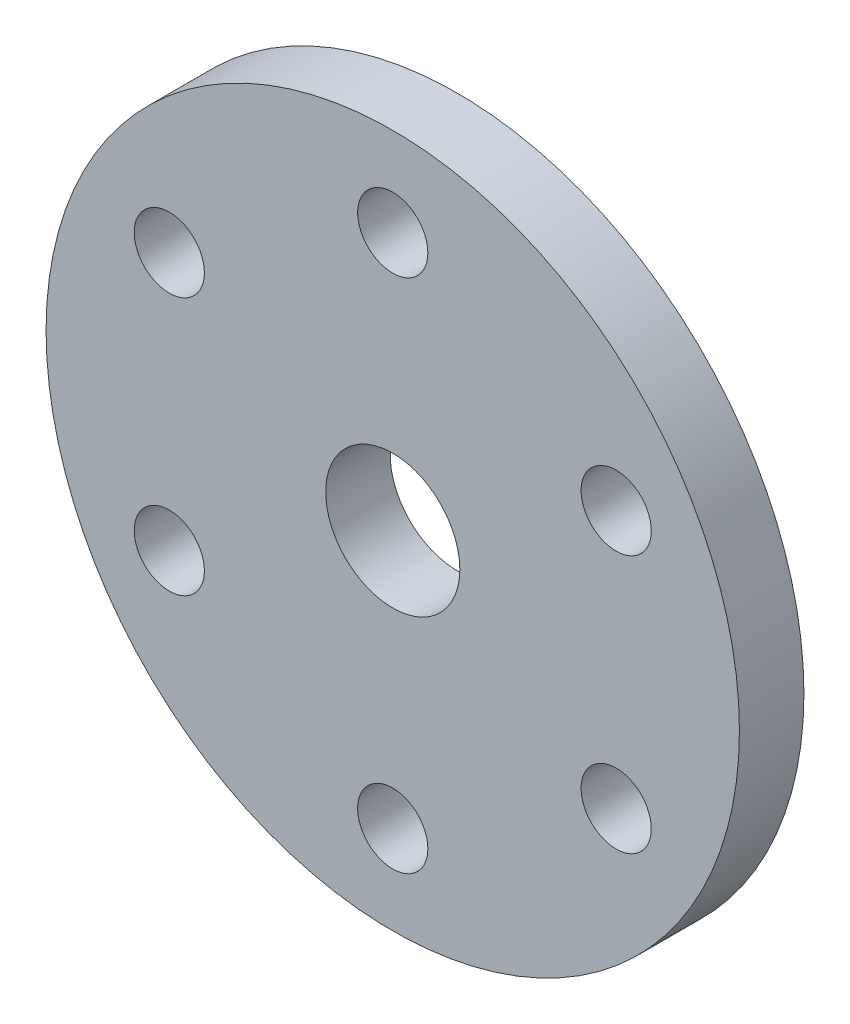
ISO-10303-21;
HEADER;
FILE_DESCRIPTION(('STEP AP214'),'2;1');
FILE_NAME('part.step','',(''),(''),'','','');
FILE_SCHEMA(('AUTOMOTIVE_DESIGN { 1 0 10303 214 1 1 1 1 }'));
ENDSEC;
DATA;
#1=APPLICATION_CONTEXT('core data for automotive mechanical design processes');
#2=APPLICATION_PROTOCOL_DEFINITION('international standard','automotive_design',2000,#1);
#3=PRODUCT_CONTEXT('',#1,'mechanical');
#4=PRODUCT('Part','Part','',(#3));
#5=PRODUCT_RELATED_PRODUCT_CATEGORY('part','',(#4));
#6=PRODUCT_DEFINITION_FORMATION('','',#4);
#7=PRODUCT_DEFINITION_CONTEXT('part definition',#1,'design');
#8=PRODUCT_DEFINITION('design','',#6,#7);
#9=PRODUCT_DEFINITION_SHAPE('','',#8);
#10=(LENGTH_UNIT() NAMED_UNIT(*) SI_UNIT(.MILLI.,.METRE.));
#11=(NAMED_UNIT(*) PLANE_ANGLE_UNIT() SI_UNIT($,.RADIAN.));
#12=(NAMED_UNIT(*) SI_UNIT($,.STERADIAN.) SOLID_ANGLE_UNIT());
#13=UNCERTAINTY_MEASURE_WITH_UNIT(LENGTH_MEASURE(1.E-05),#10,'distance_accuracy_value','');
#14=(GEOMETRIC_REPRESENTATION_CONTEXT(3) GLOBAL_UNCERTAINTY_ASSIGNED_CONTEXT((#13)) GLOBAL_UNIT_ASSIGNED_CONTEXT((#10,
#11,#12)) REPRESENTATION_CONTEXT('',''));
#15=CARTESIAN_POINT('',(0.,0.,0.));
#16=DIRECTION('',(0.,0.,1.));
#17=DIRECTION('',(1.,0.,0.));
#18=AXIS2_PLACEMENT_3D('',#15,#16,#17);
#19=CARTESIAN_POINT('',(0.,0.,3.175));
#20=DIRECTION('',(0.,0.,1.));
#21=DIRECTION('',(1.,0.,0.));
#22=AXIS2_PLACEMENT_3D('',#19,#20,#21);
#23=PLANE('',#22);
#24=CARTESIAN_POINT('',(0.,12.7,3.175));
#25=DIRECTION('',(0.,0.,1.));
#26=DIRECTION('',(1.,0.,0.));
#27=AXIS2_PLACEMENT_3D('',#24,#25,#26);
#28=CIRCLE('',#27,1.7272);
#29=CARTESIAN_POINT('',(1.7272,12.7,3.175));
#30=VERTEX_POINT('',#29);
#31=EDGE_CURVE('E85',#30,#30,#28,.T.);
#32=ORIENTED_EDGE('',*,*,#31,.F.);
#33=EDGE_LOOP('',(#32));
#34=FACE_BOUND('',#33,.T.);
#35=CARTESIAN_POINT('',(10.9985226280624,6.34999999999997,3.175));
#36=DIRECTION('',(0.,0.,1.));
#37=DIRECTION('',(1.,0.,0.));
#38=AXIS2_PLACEMENT_3D('',#35,#36,#37);
#39=CIRCLE('',#38,1.7272);
#40=CARTESIAN_POINT('',(12.7257226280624,6.34999999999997,3.175));
#41=VERTEX_POINT('',#40);
#42=EDGE_CURVE('E79',#41,#41,#39,.T.);
#43=ORIENTED_EDGE('',*,*,#42,.F.);
#44=EDGE_LOOP('',(#43));
#45=FACE_BOUND('',#44,.T.);
#46=CARTESIAN_POINT('',(10.9985226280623,-6.35000000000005,3.175));
#47=DIRECTION('',(0.,0.,1.));
#48=DIRECTION('',(1.,0.,0.));
#49=AXIS2_PLACEMENT_3D('',#46,#47,#48);
#50=CIRCLE('',#49,1.7272);
#51=CARTESIAN_POINT('',(12.7257226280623,-6.35000000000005,3.175));
#52=VERTEX_POINT('',#51);
#53=EDGE_CURVE('E73',#52,#52,#50,.T.);
#54=ORIENTED_EDGE('',*,*,#53,.F.);
#55=EDGE_LOOP('',(#54));
#56=FACE_BOUND('',#55,.T.);
#57=CARTESIAN_POINT('',(0.,-12.7,3.175));
#58=DIRECTION('',(0.,0.,1.));
#59=DIRECTION('',(1.,0.,0.));
#60=AXIS2_PLACEMENT_3D('',#57,#58,#59);
#61=CIRCLE('',#60,1.7272);
#62=CARTESIAN_POINT('',(1.72719999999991,-12.7,3.175));
#63=VERTEX_POINT('',#62);
#64=EDGE_CURVE('E67',#63,#63,#61,.T.);
#65=ORIENTED_EDGE('',*,*,#64,.F.);
#66=EDGE_LOOP('',(#65));
#67=FACE_BOUND('',#66,.T.);
#68=CARTESIAN_POINT('',(-10.9985226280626,-6.34999999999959,3.175));
#69=DIRECTION('',(0.,0.,1.));
#70=DIRECTION('',(1.,0.,0.));
#71=AXIS2_PLACEMENT_3D('',#68,#69,#70);
#72=CIRCLE('',#71,1.7272);
#73=CARTESIAN_POINT('',(-9.27132262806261,-6.34999999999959,3.175));
#74=VERTEX_POINT('',#73);
#75=EDGE_CURVE('E61',#74,#74,#72,.T.);
#76=ORIENTED_EDGE('',*,*,#75,.F.);
#77=EDGE_LOOP('',(#76));
#78=FACE_BOUND('',#77,.T.);
#79=CARTESIAN_POINT('',(-10.9985226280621,6.35000000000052,3.175));
#80=DIRECTION('',(0.,0.,1.));
#81=DIRECTION('',(1.,0.,0.));
#82=AXIS2_PLACEMENT_3D('',#79,#80,#81);
#83=CIRCLE('',#82,1.7272);
#84=CARTESIAN_POINT('',(-9.27132262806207,6.35000000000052,3.175));
#85=VERTEX_POINT('',#84);
#86=EDGE_CURVE('E55',#85,#85,#83,.T.);
#87=ORIENTED_EDGE('',*,*,#86,.F.);
#88=EDGE_LOOP('',(#87));
#89=FACE_BOUND('',#88,.T.);
#90=CARTESIAN_POINT('',(0.,0.,3.175));
#91=DIRECTION('',(0.,0.,1.));
#92=DIRECTION('',(1.,0.,0.));
#93=AXIS2_PLACEMENT_3D('',#90,#91,#92);
#94=CIRCLE('',#93,17.065625);
#95=CARTESIAN_POINT('',(17.065625,0.,3.175));
#96=VERTEX_POINT('',#95);
#97=EDGE_CURVE('E10',#96,#96,#94,.T.);
#98=ORIENTED_EDGE('',*,*,#97,.T.);
#99=EDGE_LOOP('',(#98));
#100=FACE_BOUND('',#99,.T.);
#101=CARTESIAN_POINT('',(0.,0.,3.175));
#102=DIRECTION('',(0.,0.,1.));
#103=DIRECTION('',(1.,0.,0.));
#104=AXIS2_PLACEMENT_3D('',#101,#102,#103);
#105=CIRCLE('',#104,3.302);
#106=CARTESIAN_POINT('',(3.302,0.,3.175));
#107=VERTEX_POINT('',#106);
#108=EDGE_CURVE('E46',#107,#107,#105,.T.);
#109=ORIENTED_EDGE('',*,*,#108,.F.);
#110=EDGE_LOOP('',(#109));
#111=FACE_BOUND('',#110,.T.);
#112=ADVANCED_FACE('F35',(#34,#45,#56,#67,#78,#89,#100,#111),#23,.T.);
#113=CARTESIAN_POINT('',(0.,0.,0.));
#114=DIRECTION('',(0.,0.,1.));
#115=DIRECTION('',(1.,0.,0.));
#116=AXIS2_PLACEMENT_3D('',#113,#114,#115);
#117=PLANE('',#116);
#118=CARTESIAN_POINT('',(0.,12.7,0.));
#119=DIRECTION('',(0.,0.,1.));
#120=DIRECTION('',(1.,0.,0.));
#121=AXIS2_PLACEMENT_3D('',#118,#119,#120);
#122=CIRCLE('',#121,1.7272);
#123=CARTESIAN_POINT('',(1.7272,12.7,0.));
#124=VERTEX_POINT('',#123);
#125=EDGE_CURVE('E88',#124,#124,#122,.T.);
#126=ORIENTED_EDGE('',*,*,#125,.T.);
#127=EDGE_LOOP('',(#126));
#128=FACE_BOUND('',#127,.T.);
#129=CARTESIAN_POINT('',(10.9985226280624,6.34999999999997,0.));
#130=DIRECTION('',(0.,0.,1.));
#131=DIRECTION('',(1.,0.,0.));
#132=AXIS2_PLACEMENT_3D('',#129,#130,#131);
#133=CIRCLE('',#132,1.7272);
#134=CARTESIAN_POINT('',(12.7257226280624,6.34999999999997,0.));
#135=VERTEX_POINT('',#134);
#136=EDGE_CURVE('E82',#135,#135,#133,.T.);
#137=ORIENTED_EDGE('',*,*,#136,.T.);
#138=EDGE_LOOP('',(#137));
#139=FACE_BOUND('',#138,.T.);
#140=CARTESIAN_POINT('',(10.9985226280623,-6.35000000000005,0.));
#141=DIRECTION('',(0.,0.,1.));
#142=DIRECTION('',(1.,0.,0.));
#143=AXIS2_PLACEMENT_3D('',#140,#141,#142);
#144=CIRCLE('',#143,1.7272);
#145=CARTESIAN_POINT('',(12.7257226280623,-6.35000000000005,0.));
#146=VERTEX_POINT('',#145);
#147=EDGE_CURVE('E76',#146,#146,#144,.T.);
#148=ORIENTED_EDGE('',*,*,#147,.T.);
#149=EDGE_LOOP('',(#148));
#150=FACE_BOUND('',#149,.T.);
#151=CARTESIAN_POINT('',(0.,-12.7,0.));
#152=DIRECTION('',(0.,0.,1.));
#153=DIRECTION('',(1.,0.,0.));
#154=AXIS2_PLACEMENT_3D('',#151,#152,#153);
#155=CIRCLE('',#154,1.7272);
#156=CARTESIAN_POINT('',(1.72719999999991,-12.7,0.));
#157=VERTEX_POINT('',#156);
#158=EDGE_CURVE('E70',#157,#157,#155,.T.);
#159=ORIENTED_EDGE('',*,*,#158,.T.);
#160=EDGE_LOOP('',(#159));
#161=FACE_BOUND('',#160,.T.);
#162=CARTESIAN_POINT('',(-10.9985226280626,-6.34999999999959,0.));
#163=DIRECTION('',(0.,0.,1.));
#164=DIRECTION('',(1.,0.,0.));
#165=AXIS2_PLACEMENT_3D('',#162,#163,#164);
#166=CIRCLE('',#165,1.7272);
#167=CARTESIAN_POINT('',(-9.27132262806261,-6.34999999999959,0.));
#168=VERTEX_POINT('',#167);
#169=EDGE_CURVE('E64',#168,#168,#166,.T.);
#170=ORIENTED_EDGE('',*,*,#169,.T.);
#171=EDGE_LOOP('',(#170));
#172=FACE_BOUND('',#171,.T.);
#173=CARTESIAN_POINT('',(-10.9985226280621,6.35000000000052,0.));
#174=DIRECTION('',(0.,0.,1.));
#175=DIRECTION('',(1.,0.,0.));
#176=AXIS2_PLACEMENT_3D('',#173,#174,#175);
#177=CIRCLE('',#176,1.7272);
#178=CARTESIAN_POINT('',(-9.27132262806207,6.35000000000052,0.));
#179=VERTEX_POINT('',#178);
#180=EDGE_CURVE('E58',#179,#179,#177,.T.);
#181=ORIENTED_EDGE('',*,*,#180,.T.);
#182=EDGE_LOOP('',(#181));
#183=FACE_BOUND('',#182,.T.);
#184=CARTESIAN_POINT('',(0.,0.,0.));
#185=DIRECTION('',(0.,0.,1.));
#186=DIRECTION('',(1.,0.,0.));
#187=AXIS2_PLACEMENT_3D('',#184,#185,#186);
#188=CIRCLE('',#187,17.065625);
#189=CARTESIAN_POINT('',(17.065625,0.,0.));
#190=VERTEX_POINT('',#189);
#191=EDGE_CURVE('E42',#190,#190,#188,.T.);
#192=ORIENTED_EDGE('',*,*,#191,.F.);
#193=EDGE_LOOP('',(#192));
#194=FACE_BOUND('',#193,.T.);
#195=CARTESIAN_POINT('',(0.,0.,0.));
#196=DIRECTION('',(0.,0.,1.));
#197=DIRECTION('',(1.,0.,0.));
#198=AXIS2_PLACEMENT_3D('',#195,#196,#197);
#199=CIRCLE('',#198,3.302);
#200=CARTESIAN_POINT('',(3.302,0.,0.));
#201=VERTEX_POINT('',#200);
#202=EDGE_CURVE('E50',#201,#201,#199,.T.);
#203=ORIENTED_EDGE('',*,*,#202,.T.);
#204=EDGE_LOOP('',(#203));
#205=FACE_BOUND('',#204,.T.);
#206=ADVANCED_FACE('F92',(#128,#139,#150,#161,#172,#183,#194,#205),#117,.F.);
#207=CARTESIAN_POINT('',(0.,0.,3.175));
#208=DIRECTION('',(0.,0.,-1.));
#209=DIRECTION('',(-1.,0.,0.));
#210=AXIS2_PLACEMENT_3D('',#207,#208,#209);
#211=CYLINDRICAL_SURFACE('',#210,17.065625);
#212=ORIENTED_EDGE('',*,*,#97,.F.);
#213=EDGE_LOOP('',(#212));
#214=FACE_BOUND('',#213,.T.);
#215=ORIENTED_EDGE('',*,*,#191,.T.);
#216=EDGE_LOOP('',(#215));
#217=FACE_BOUND('',#216,.T.);
#218=ADVANCED_FACE('F37',(#214,#217),#211,.T.);
#219=CARTESIAN_POINT('',(0.,0.,3.175));
#220=DIRECTION('',(0.,0.,-1.));
#221=DIRECTION('',(-1.,0.,0.));
#222=AXIS2_PLACEMENT_3D('',#219,#220,#221);
#223=CYLINDRICAL_SURFACE('',#222,3.302);
#224=ORIENTED_EDGE('',*,*,#108,.T.);
#225=EDGE_LOOP('',(#224));
#226=FACE_BOUND('',#225,.T.);
#227=ORIENTED_EDGE('',*,*,#202,.F.);
#228=EDGE_LOOP('',(#227));
#229=FACE_BOUND('',#228,.T.);
#230=ADVANCED_FACE('F116',(#226,#229),#223,.F.);
#231=CARTESIAN_POINT('',(-10.9985226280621,6.35000000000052,3.175));
#232=DIRECTION('',(0.,0.,1.));
#233=DIRECTION('',(1.,0.,0.));
#234=AXIS2_PLACEMENT_3D('',#231,#232,#233);
#235=CYLINDRICAL_SURFACE('',#234,1.7272);
#236=ORIENTED_EDGE('',*,*,#180,.F.);
#237=EDGE_LOOP('',(#236));
#238=FACE_BOUND('',#237,.T.);
#239=ORIENTED_EDGE('',*,*,#86,.T.);
#240=EDGE_LOOP('',(#239));
#241=FACE_BOUND('',#240,.T.);
#242=ADVANCED_FACE('F119',(#238,#241),#235,.F.);
#243=CARTESIAN_POINT('',(-10.9985226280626,-6.34999999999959,3.175));
#244=DIRECTION('',(0.,0.,1.));
#245=DIRECTION('',(1.,0.,0.));
#246=AXIS2_PLACEMENT_3D('',#243,#244,#245);
#247=CYLINDRICAL_SURFACE('',#246,1.7272);
#248=ORIENTED_EDGE('',*,*,#169,.F.);
#249=EDGE_LOOP('',(#248));
#250=FACE_BOUND('',#249,.T.);
#251=ORIENTED_EDGE('',*,*,#75,.T.);
#252=EDGE_LOOP('',(#251));
#253=FACE_BOUND('',#252,.T.);
#254=ADVANCED_FACE('F132',(#250,#253),#247,.F.);
#255=CARTESIAN_POINT('',(0.,-12.7,3.175));
#256=DIRECTION('',(0.,0.,1.));
#257=DIRECTION('',(1.,0.,0.));
#258=AXIS2_PLACEMENT_3D('',#255,#256,#257);
#259=CYLINDRICAL_SURFACE('',#258,1.7272);
#260=ORIENTED_EDGE('',*,*,#158,.F.);
#261=EDGE_LOOP('',(#260));
#262=FACE_BOUND('',#261,.T.);
#263=ORIENTED_EDGE('',*,*,#64,.T.);
#264=EDGE_LOOP('',(#263));
#265=FACE_BOUND('',#264,.T.);
#266=ADVANCED_FACE('F136',(#262,#265),#259,.F.);
#267=CARTESIAN_POINT('',(10.9985226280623,-6.35000000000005,3.175));
#268=DIRECTION('',(0.,0.,1.));
#269=DIRECTION('',(1.,0.,0.));
#270=AXIS2_PLACEMENT_3D('',#267,#268,#269);
#271=CYLINDRICAL_SURFACE('',#270,1.7272);
#272=ORIENTED_EDGE('',*,*,#147,.F.);
#273=EDGE_LOOP('',(#272));
#274=FACE_BOUND('',#273,.T.);
#275=ORIENTED_EDGE('',*,*,#53,.T.);
#276=EDGE_LOOP('',(#275));
#277=FACE_BOUND('',#276,.T.);
#278=ADVANCED_FACE('F140',(#274,#277),#271,.F.);
#279=CARTESIAN_POINT('',(10.9985226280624,6.34999999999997,3.175));
#280=DIRECTION('',(0.,0.,1.));
#281=DIRECTION('',(1.,0.,0.));
#282=AXIS2_PLACEMENT_3D('',#279,#280,#281);
#283=CYLINDRICAL_SURFACE('',#282,1.7272);
#284=ORIENTED_EDGE('',*,*,#136,.F.);
#285=EDGE_LOOP('',(#284));
#286=FACE_BOUND('',#285,.T.);
#287=ORIENTED_EDGE('',*,*,#42,.T.);
#288=EDGE_LOOP('',(#287));
#289=FACE_BOUND('',#288,.T.);
#290=ADVANCED_FACE('F98',(#286,#289),#283,.F.);
#291=CARTESIAN_POINT('',(0.,12.7,3.175));
#292=DIRECTION('',(0.,0.,1.));
#293=DIRECTION('',(1.,0.,0.));
#294=AXIS2_PLACEMENT_3D('',#291,#292,#293);
#295=CYLINDRICAL_SURFACE('',#294,1.7272);
#296=ORIENTED_EDGE('',*,*,#125,.F.);
#297=EDGE_LOOP('',(#296));
#298=FACE_BOUND('',#297,.T.);
#299=ORIENTED_EDGE('',*,*,#31,.T.);
#300=EDGE_LOOP('',(#299));
#301=FACE_BOUND('',#300,.T.);
#302=ADVANCED_FACE('F95',(#298,#301),#295,.F.);
#303=CLOSED_SHELL('',(#112,#206,#218,#230,#242,#254,#266,#278,#290,#302));
#304=MANIFOLD_SOLID_BREP('B2',#303);
#305=ADVANCED_BREP_SHAPE_REPRESENTATION('',(#18,#304),#14);
#306=SHAPE_DEFINITION_REPRESENTATION(#9,#305);
ENDSEC;
END-ISO-10303-21;
